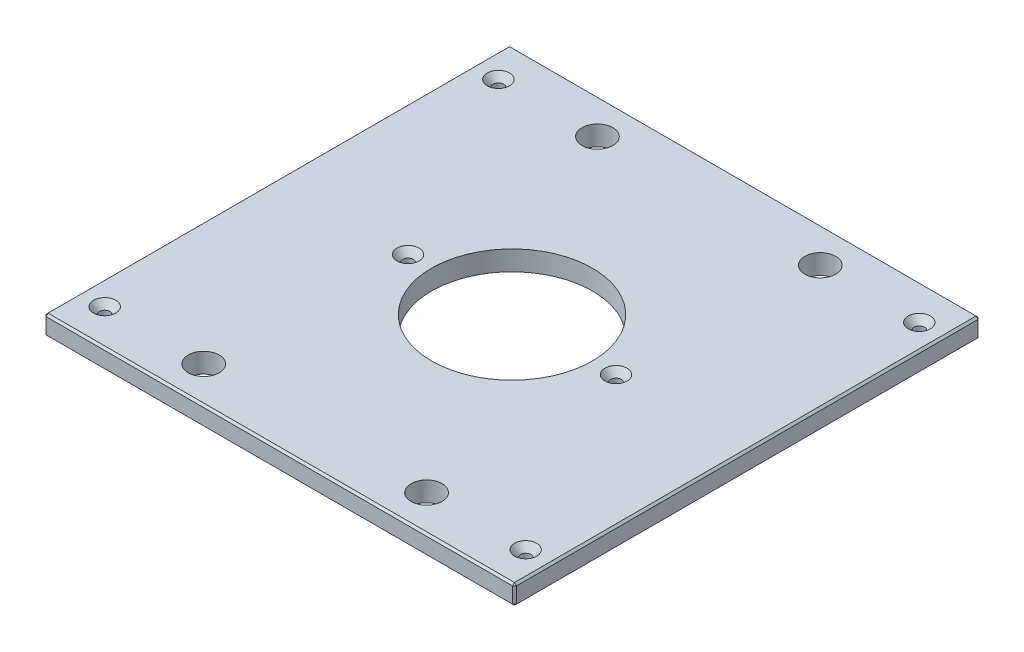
from build123d import *

# Parameters (mm, degrees)
SKETCH1_W                                        = 301.625
SKETCH1_H                                        = 298.45
BOSS_EXTRUDE1_DEPTH                              = 12.7
SKETCH13_R                                       = 51.562
CUT_EXTRUDE6_DEPTH                               = 213.541291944
F_25_32_0_78125_DIAMETER_HOLE1_D                 = 19.84375
CHAMFER2_SIZE                                    = 1.27
CSK_FOR_1_4_FLAT_HEAD_MACHINE_SCREW1_D           = 6.7564
CSK_FOR_1_4_FLAT_HEAD_MACHINE_SCREW1_CSINK_D     = 14.2748
CSK_FOR_1_4_FLAT_HEAD_MACHINE_SCREW1_CSINK_ANGLE = 82


with BuildPart() as part:
    # Sketch1 → Boss-Extrude1 (new body)
    with BuildSketch(Plane(origin=(0, 0, 0), x_dir=(1, 0, 0), z_dir=(0, 1, 0))):
        Rectangle(SKETCH1_W, SKETCH1_H)
    extrude(amount=BOSS_EXTRUDE1_DEPTH)

    # Sketch13 → Cut-Extrude6 (cut, through all)
    with BuildSketch(Plane(origin=(0, 12.7, 0), x_dir=(1, 0, 0), z_dir=(0, 1, 0))):
        with Locations(Location((0, 0, 0), (0, 0, 270))):
            Circle(SKETCH13_R)
    extrude(amount=-CUT_EXTRUDE6_DEPTH, mode=Mode.SUBTRACT)

    # 25_32 _0.78125_ Diameter Hole1 (through all)
    with Locations(Plane(origin=(0, 12.7, 0), x_dir=(1, 0, 0), z_dir=(0, 1, 0))):
        with Locations((71.4375, 126.20498), (-71.4375, 126.20498), (71.4375, -126.20498), (-71.4375, -126.20498)):
            Hole(F_25_32_0_78125_DIAMETER_HOLE1_D / 2)

    # Chamfer2
    chamfer2_edges = [part.edges().sort_by_distance(p)[0] for p in [
        (150.8125, 12.7, 0),
        (0, 12.7, -149.225),
        (-150.8125, 12.7, 0),
        (0, 0, -149.225),
        (150.8125, 0, 0),
        (0, 0, 149.225),
        (-150.8125, 0, 0),
        (0, 12.7, 149.225),
        (-150.8125, 6.35, -149.225),
        (150.8125, 6.35, -149.225),
        (150.8125, 6.35, 149.225),
        (-150.8125, 6.35, 149.225),
    ]]
    chamfer(chamfer2_edges, length=CHAMFER2_SIZE)

    # CSK for 1_4 Flat Head Machine Screw1 (through all)
    with Locations(Plane(origin=(0, 12.7, 0), x_dir=(1, 0, 0), z_dir=(0, 1, 0))):
        with Locations((134.9375, 126.20498), (134.9375, -126.20498), (-134.9375, -126.20498), (-66.675, 0), (66.675, 0), (-134.9375, 126.20498), (-71.4375, 126.20498), (-71.4375, -126.20498)):
            CounterSinkHole(CSK_FOR_1_4_FLAT_HEAD_MACHINE_SCREW1_D / 2, CSK_FOR_1_4_FLAT_HEAD_MACHINE_SCREW1_CSINK_D / 2, counter_sink_angle=CSK_FOR_1_4_FLAT_HEAD_MACHINE_SCREW1_CSINK_ANGLE)


solid = part.part
